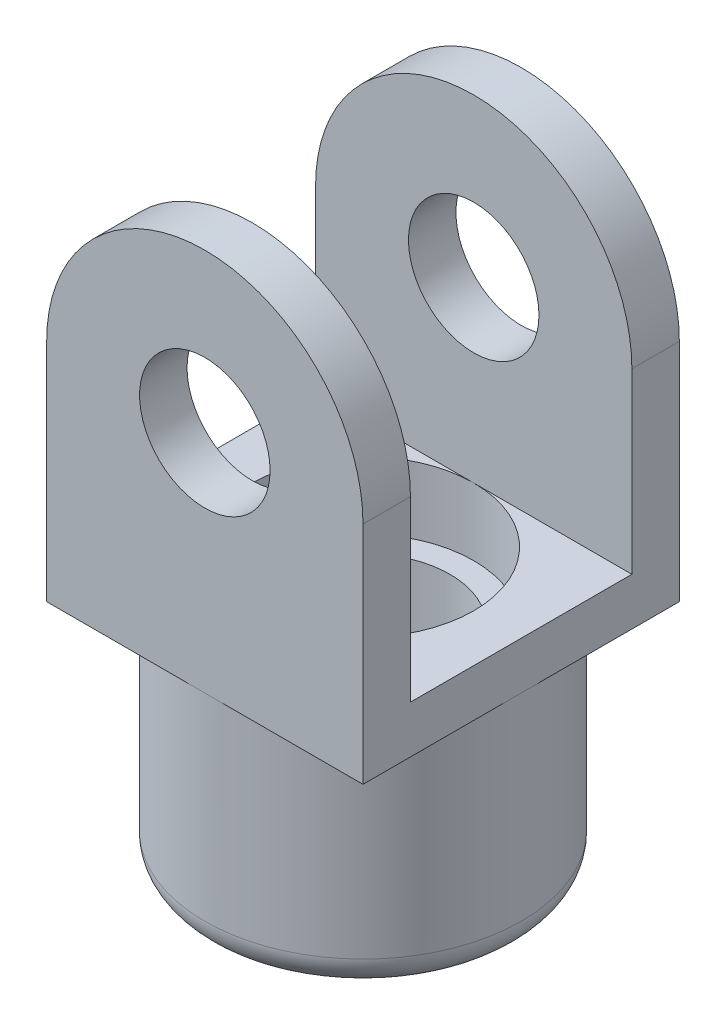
from build123d import *

# Parameters (mm, degrees)
BASE_EXTRUDE_DEPTH  = 5.08
SHELL1_T            = -1.524
SKETCH2_R           = 2.0955
CUT_EXTRUDE1_DEPTH  = 17.756782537
SKETCH4_R           = 5.08
BOSS_EXTRUDE1_DEPTH = 7.366
SKETCH5_R           = 2.794
CUT_EXTRUDE2_DEPTH  = 21.955
SKETCH3_R           = 3.556
CUT_EXTRUDE3_DEPTH  = 2.159
SKETCH6_R           = 3.937
CUT_EXTRUDE4_DEPTH  = 2.159
FILLET1_R           = 1.016


with BuildPart() as part:
    # Sketch1 → Base-Extrude (new, symmetric)
    with BuildSketch(Plane.XY):
        with BuildLine():
            Line((-5.08, 0), (5.08, 0))
            Line((5.08, 0), (5.08, 7.239))
            ThreePointArc((5.08, 7.239), (0, 12.319), (-5.08, 7.239))
            Line((-5.08, 7.239), (-5.08, 0))
        make_face()
    extrude(amount=BASE_EXTRUDE_DEPTH, both=True)

    # Shell1
    shell1_openings = [part.faces().sort_by_distance(p)[0] for p in [
        (5.08, 3.6195, 0),
        (0, 12.319, 0),
        (-5.08, 3.6195, 0),
    ]]
    offset(amount=SHELL1_T, openings=shell1_openings, kind=Kind.INTERSECTION)

    # Sketch2 → Cut-Extrude1 (cut, through all)
    with BuildSketch(Plane.XY.offset(5.08)):
        with Locations((0, 7.239)):
            Circle(SKETCH2_R)
    extrude(amount=-CUT_EXTRUDE1_DEPTH, mode=Mode.SUBTRACT)

    # Sketch4 → Boss-Extrude1 (add)
    with BuildSketch(Plane.XZ):
        Circle(SKETCH4_R)
    extrude(amount=BOSS_EXTRUDE1_DEPTH)

    # Sketch5 → Cut-Extrude2 (cut, through all)
    with BuildSketch(Plane.XZ.offset(7.366)):
        Circle(SKETCH5_R)
    extrude(amount=-CUT_EXTRUDE2_DEPTH, mode=Mode.SUBTRACT)

    # Sketch3 → Cut-Extrude3 (cut)
    with BuildSketch(Plane(origin=(0, 1.524, 0), x_dir=(-1, 0, 0), z_dir=(0, 1, 0))):
        Circle(SKETCH3_R)
    extrude(amount=-CUT_EXTRUDE3_DEPTH, mode=Mode.SUBTRACT)

    # Sketch6 → Cut-Extrude4 (cut)
    with BuildSketch(Plane.XZ.offset(7.366)):
        Circle(SKETCH6_R)
    extrude(amount=-CUT_EXTRUDE4_DEPTH, mode=Mode.SUBTRACT)

    # Fillet1
    fillet1_edges = [part.edges().sort_by_distance(p)[0] for p in [
        (-5.08, -7.366, 0),
    ]]
    fillet(fillet1_edges, radius=FILLET1_R)


solid = part.part
